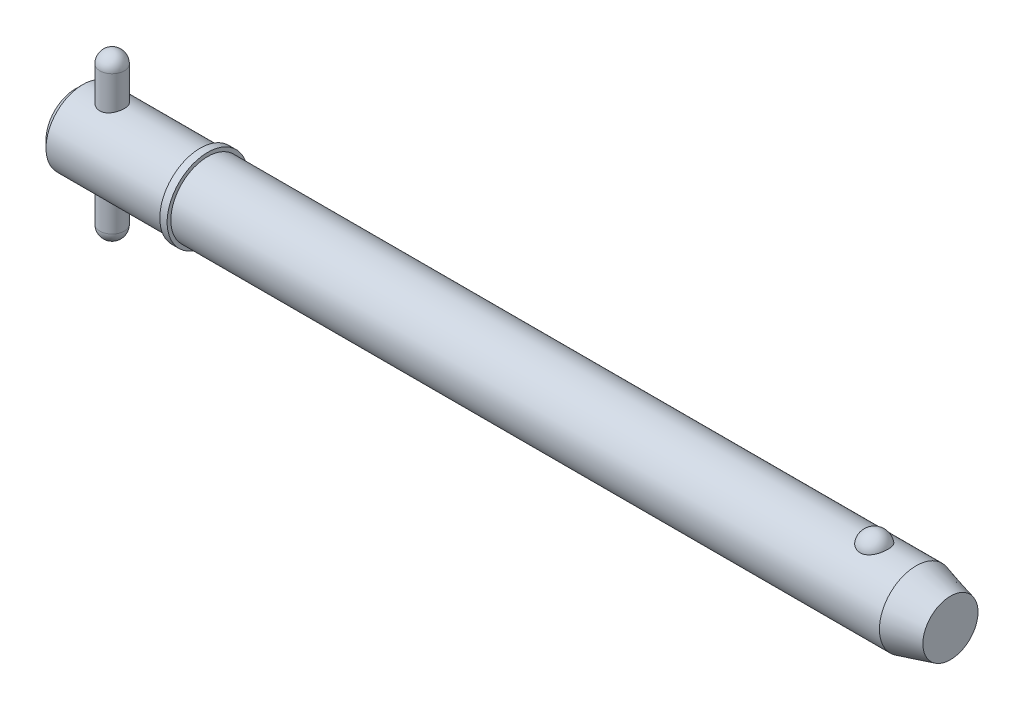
ISO-10303-21;
HEADER;
FILE_DESCRIPTION(('STEP AP214'),'2;1');
FILE_NAME('part.step','',(''),(''),'','','');
FILE_SCHEMA(('AUTOMOTIVE_DESIGN { 1 0 10303 214 1 1 1 1 }'));
ENDSEC;
DATA;
#1=APPLICATION_CONTEXT('core data for automotive mechanical design processes');
#2=APPLICATION_PROTOCOL_DEFINITION('international standard','automotive_design',2000,#1);
#3=PRODUCT_CONTEXT('',#1,'mechanical');
#4=PRODUCT('Part','Part','',(#3));
#5=PRODUCT_RELATED_PRODUCT_CATEGORY('part','',(#4));
#6=PRODUCT_DEFINITION_FORMATION('','',#4);
#7=PRODUCT_DEFINITION_CONTEXT('part definition',#1,'design');
#8=PRODUCT_DEFINITION('design','',#6,#7);
#9=PRODUCT_DEFINITION_SHAPE('','',#8);
#10=(LENGTH_UNIT() NAMED_UNIT(*) SI_UNIT(.MILLI.,.METRE.));
#11=(NAMED_UNIT(*) PLANE_ANGLE_UNIT() SI_UNIT($,.RADIAN.));
#12=(NAMED_UNIT(*) SI_UNIT($,.STERADIAN.) SOLID_ANGLE_UNIT());
#13=UNCERTAINTY_MEASURE_WITH_UNIT(LENGTH_MEASURE(1.E-05),#10,'distance_accuracy_value','');
#14=(GEOMETRIC_REPRESENTATION_CONTEXT(3) GLOBAL_UNCERTAINTY_ASSIGNED_CONTEXT((#13)) GLOBAL_UNIT_ASSIGNED_CONTEXT((#10,
#11,#12)) REPRESENTATION_CONTEXT('',''));
#15=CARTESIAN_POINT('',(0.,0.,0.));
#16=DIRECTION('',(0.,0.,1.));
#17=DIRECTION('',(1.,0.,0.));
#18=AXIS2_PLACEMENT_3D('',#15,#16,#17);
#19=CARTESIAN_POINT('',(7.14,15.875,0.));
#20=DIRECTION('',(0.,-1.,0.));
#21=DIRECTION('',(0.,0.,-1.));
#22=AXIS2_PLACEMENT_3D('',#19,#20,#21);
#23=CYLINDRICAL_SURFACE('',#22,2.38);
#24=CARTESIAN_POINT('',(7.14,-13.495,0.));
#25=DIRECTION('',(0.,-1.,0.));
#26=DIRECTION('',(0.,0.,-1.));
#27=AXIS2_PLACEMENT_3D('',#24,#25,#26);
#28=CIRCLE('',#27,2.38);
#29=CARTESIAN_POINT('',(7.14,-13.495,-2.38));
#30=VERTEX_POINT('',#29);
#31=EDGE_CURVE('P0_E10',#30,#30,#28,.F.);
#32=ORIENTED_EDGE('',*,*,#31,.T.);
#33=EDGE_LOOP('',(#32));
#34=FACE_BOUND('',#33,.T.);
#35=CARTESIAN_POINT('',(7.14,13.495,0.));
#36=DIRECTION('',(0.,-1.,0.));
#37=DIRECTION('',(0.,0.,-1.));
#38=AXIS2_PLACEMENT_3D('',#35,#36,#37);
#39=CIRCLE('',#38,2.38);
#40=CARTESIAN_POINT('',(7.14,13.495,-2.38));
#41=VERTEX_POINT('',#40);
#42=EDGE_CURVE('P0_E21',#41,#41,#39,.T.);
#43=ORIENTED_EDGE('',*,*,#42,.T.);
#44=EDGE_LOOP('',(#43));
#45=FACE_BOUND('',#44,.T.);
#46=ADVANCED_FACE('P0_F14',(#34,#45),#23,.T.);
#47=CARTESIAN_POINT('',(7.14,-13.495,0.));
#48=DIRECTION('',(0.,0.,1.));
#49=DIRECTION('',(1.,0.,0.));
#50=AXIS2_PLACEMENT_3D('',#47,#48,#49);
#51=SPHERICAL_SURFACE('',#50,2.38);
#52=CARTESIAN_POINT('',(7.14,-13.495,0.));
#53=DIRECTION('',(0.,-1.,0.));
#54=DIRECTION('',(0.,0.,-1.));
#55=AXIS2_PLACEMENT_3D('',#52,#53,#54);
#56=SPHERICAL_SURFACE('',#55,2.38);
#57=ORIENTED_EDGE('',*,*,#31,.F.);
#58=EDGE_LOOP('',(#57));
#59=FACE_BOUND('',#58,.T.);
#60=ADVANCED_FACE('P0_F29',(#59),#56,.T.);
#61=CARTESIAN_POINT('',(7.14,13.495,0.));
#62=DIRECTION('',(0.,0.,1.));
#63=DIRECTION('',(1.,0.,0.));
#64=AXIS2_PLACEMENT_3D('',#61,#62,#63);
#65=SPHERICAL_SURFACE('',#64,2.38);
#66=CARTESIAN_POINT('',(7.14,13.495,0.));
#67=DIRECTION('',(0.,-1.,0.));
#68=DIRECTION('',(0.,0.,-1.));
#69=AXIS2_PLACEMENT_3D('',#66,#67,#68);
#70=SPHERICAL_SURFACE('',#69,2.38);
#71=ORIENTED_EDGE('',*,*,#42,.F.);
#72=EDGE_LOOP('',(#71));
#73=FACE_BOUND('',#72,.T.);
#74=ADVANCED_FACE('P0_F16',(#73),#70,.T.);
#75=CLOSED_SHELL('',(#46,#60,#74));
#76=MANIFOLD_SOLID_BREP('P0_B1',#75);
#77=CARTESIAN_POINT('',(0.,0.,0.));
#78=DIRECTION('',(1.,0.,0.));
#79=DIRECTION('',(0.,0.,-1.));
#80=AXIS2_PLACEMENT_3D('',#77,#78,#79);
#81=CYLINDRICAL_SURFACE('',#80,7.145);
#82=CARTESIAN_POINT('',(163.48362424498,0.,0.));
#83=DIRECTION('',(1.,0.,0.));
#84=DIRECTION('',(0.,0.,-1.));
#85=AXIS2_PLACEMENT_3D('',#82,#83,#84);
#86=CIRCLE('',#85,7.145);
#87=CARTESIAN_POINT('',(163.48362424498,0.,-7.145));
#88=VERTEX_POINT('',#87);
#89=EDGE_CURVE('P1_E81',#88,#88,#86,.T.);
#90=ORIENTED_EDGE('',*,*,#89,.F.);
#91=EDGE_LOOP('',(#90));
#92=FACE_BOUND('',#91,.T.);
#93=CARTESIAN_POINT('',(25.7,0.,0.));
#94=DIRECTION('',(1.,0.,0.));
#95=DIRECTION('',(0.,0.,-1.));
#96=AXIS2_PLACEMENT_3D('',#93,#94,#95);
#97=CIRCLE('',#96,7.145);
#98=CARTESIAN_POINT('',(25.7,0.,-7.145));
#99=VERTEX_POINT('',#98);
#100=EDGE_CURVE('P1_E85',#99,#99,#97,.T.);
#101=ORIENTED_EDGE('',*,*,#100,.T.);
#102=EDGE_LOOP('',(#101));
#103=FACE_BOUND('',#102,.T.);
#104=CARTESIAN_POINT('',(155.339503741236,6.60328629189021,2.72903557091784));
#105=CARTESIAN_POINT('',(155.198315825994,6.60329644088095,2.7290249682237));
#106=CARTESIAN_POINT('',(155.056883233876,6.60799490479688,2.71772840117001));
#107=CARTESIAN_POINT('',(154.777955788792,6.62628236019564,2.6728193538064));
#108=CARTESIAN_POINT('',(154.640472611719,6.63989534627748,2.63914664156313));
#109=CARTESIAN_POINT('',(154.373889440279,6.67440775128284,2.55059642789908));
#110=CARTESIAN_POINT('',(154.244768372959,6.69528793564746,2.49577486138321));
#111=CARTESIAN_POINT('',(153.997869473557,6.74205585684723,2.36651799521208));
#112=CARTESIAN_POINT('',(153.880086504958,6.76794130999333,2.2920916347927));
#113=CARTESIAN_POINT('',(153.65516710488,6.82286177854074,2.12312937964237));
#114=CARTESIAN_POINT('',(153.548440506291,6.85196655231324,2.0280710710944));
#115=CARTESIAN_POINT('',(153.351918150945,6.90970232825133,1.82167822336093));
#116=CARTESIAN_POINT('',(153.262127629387,6.93833318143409,1.71033867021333));
#117=CARTESIAN_POINT('',(153.097667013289,6.9935167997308,1.46891951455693));
#118=CARTESIAN_POINT('',(153.023844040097,7.01992110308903,1.33822781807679));
#119=CARTESIAN_POINT('',(152.898088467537,7.06643385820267,1.0656656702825));
#120=CARTESIAN_POINT('',(152.84615735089,7.08654188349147,0.923794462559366));
#121=CARTESIAN_POINT('',(152.764732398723,7.11862399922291,0.630993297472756));
#122=CARTESIAN_POINT('',(152.735516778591,7.13049704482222,0.479974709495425));
#123=CARTESIAN_POINT('',(152.701174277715,7.14449484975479,0.174782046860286));
#124=CARTESIAN_POINT('',(152.696046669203,7.14661990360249,0.020608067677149));
#125=CARTESIAN_POINT('',(152.709938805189,7.14092465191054,-0.285506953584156));
#126=CARTESIAN_POINT('',(152.728810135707,7.1331654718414,-0.437455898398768));
#127=CARTESIAN_POINT('',(152.790062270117,7.10859076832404,-0.73577860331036));
#128=CARTESIAN_POINT('',(152.832443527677,7.0917750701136,-0.882152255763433));
#129=CARTESIAN_POINT('',(152.939934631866,7.05076716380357,-1.16543149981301));
#130=CARTESIAN_POINT('',(153.005075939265,7.02656475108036,-1.30232366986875));
#131=CARTESIAN_POINT('',(153.156759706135,6.97329145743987,-1.56265907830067));
#132=CARTESIAN_POINT('',(153.243303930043,6.94422017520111,-1.68610120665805));
#133=CARTESIAN_POINT('',(153.436465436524,6.88415108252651,-1.91671004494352));
#134=CARTESIAN_POINT('',(153.543180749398,6.85314438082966,-2.02379244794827));
#135=CARTESIAN_POINT('',(153.773974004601,6.79282069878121,-2.21787433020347));
#136=CARTESIAN_POINT('',(153.898050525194,6.76350358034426,-2.30487545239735));
#137=CARTESIAN_POINT('',(154.157678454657,6.71060580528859,-2.45458647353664));
#138=CARTESIAN_POINT('',(154.292938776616,6.68691885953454,-2.51776240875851));
#139=CARTESIAN_POINT('',(154.573277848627,6.64741247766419,-2.62030218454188));
#140=CARTESIAN_POINT('',(154.718352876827,6.63159007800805,-2.65967499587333));
#141=CARTESIAN_POINT('',(155.006347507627,6.61038594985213,-2.71193301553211));
#142=CARTESIAN_POINT('',(155.14900807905,6.60451880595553,-2.72605165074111));
#143=CARTESIAN_POINT('',(155.434800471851,6.60240611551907,-2.73116688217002));
#144=CARTESIAN_POINT('',(155.577932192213,6.60615862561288,-2.7221681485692));
#145=CARTESIAN_POINT('',(155.855848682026,6.62256094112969,-2.68200435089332));
#146=CARTESIAN_POINT('',(155.990754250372,6.63492533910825,-2.65154998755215));
#147=CARTESIAN_POINT('',(156.25332009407,6.66687445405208,-2.57015684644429));
#148=CARTESIAN_POINT('',(156.38097978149,6.68645975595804,-2.51921640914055));
#149=CARTESIAN_POINT('',(156.628577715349,6.73127274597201,-2.39693610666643));
#150=CARTESIAN_POINT('',(156.748287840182,6.7566138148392,-2.32517694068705));
#151=CARTESIAN_POINT('',(156.974159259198,6.81006003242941,-2.16363812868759));
#152=CARTESIAN_POINT('',(157.080317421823,6.83816581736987,-2.07385432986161));
#153=CARTESIAN_POINT('',(157.281862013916,6.89580469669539,-1.87357235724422));
#154=CARTESIAN_POINT('',(157.376440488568,6.92533863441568,-1.76226074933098));
#155=CARTESIAN_POINT('',(157.546332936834,6.98139526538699,-1.5251169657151));
#156=CARTESIAN_POINT('',(157.621643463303,7.0079174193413,-1.39928219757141));
#157=CARTESIAN_POINT('',(157.753595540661,7.05607625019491,-1.1321597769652));
#158=CARTESIAN_POINT('',(157.809568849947,7.07753119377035,-0.990508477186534));
#159=CARTESIAN_POINT('',(157.898296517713,7.11222355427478,-0.699154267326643));
#160=CARTESIAN_POINT('',(157.931050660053,7.12546089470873,-0.549451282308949));
#161=CARTESIAN_POINT('',(157.972689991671,7.14237584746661,-0.246120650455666));
#162=CARTESIAN_POINT('',(157.981558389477,7.14604673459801,-0.0924903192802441));
#163=CARTESIAN_POINT('',(157.975194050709,7.14343510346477,0.214181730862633));
#164=CARTESIAN_POINT('',(157.959961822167,7.13715279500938,0.367223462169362));
#165=CARTESIAN_POINT('',(157.905845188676,7.1153294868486,0.667595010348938));
#166=CARTESIAN_POINT('',(157.867077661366,7.09983424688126,0.814949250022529));
#167=CARTESIAN_POINT('',(157.766770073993,7.06119140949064,1.1006322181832));
#168=CARTESIAN_POINT('',(157.705228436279,7.03804328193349,1.23896032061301));
#169=CARTESIAN_POINT('',(157.560207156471,6.98632429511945,1.50352300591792));
#170=CARTESIAN_POINT('',(157.476606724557,6.95772382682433,1.62968561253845));
#171=CARTESIAN_POINT('',(157.28938046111,6.89823072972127,1.86554304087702));
#172=CARTESIAN_POINT('',(157.185755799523,6.86733823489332,1.97523882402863));
#173=CARTESIAN_POINT('',(156.961076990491,6.80676456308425,2.174822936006));
#174=CARTESIAN_POINT('',(156.840067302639,6.7770805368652,2.26476035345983));
#175=CARTESIAN_POINT('',(156.583340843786,6.7223050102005,2.42252989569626));
#176=CARTESIAN_POINT('',(156.44761851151,6.69721525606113,2.4903536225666));
#177=CARTESIAN_POINT('',(156.170402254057,6.65552591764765,2.59967646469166));
#178=CARTESIAN_POINT('',(156.029281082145,6.63865794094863,2.6420201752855));
#179=CARTESIAN_POINT('',(155.741444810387,6.61425039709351,2.70255841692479));
#180=CARTESIAN_POINT('',(155.594748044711,6.606682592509,2.72082606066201));
#181=CARTESIAN_POINT('',(155.411679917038,6.60358754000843,2.72830331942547));
#182=CARTESIAN_POINT('',(155.375599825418,6.60328369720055,2.72903828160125));
#183=CARTESIAN_POINT('',(155.339503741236,6.60328629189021,2.72903557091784));
#184=B_SPLINE_CURVE_WITH_KNOTS('',3,(#104,#105,#106,#107,#108,#109,#110,#111,#112,#113,#114,
#115,#116,#117,#118,#119,#120,#121,#122,#123,#124,#125,#126,#127,#128,#129,#130,#131,#132,#133,
#134,#135,#136,#137,#138,#139,#140,#141,#142,#143,#144,#145,#146,#147,#148,#149,#150,#151,#152,
#153,#154,#155,#156,#157,#158,#159,#160,#161,#162,#163,#164,#165,#166,#167,#168,#169,#170,#171,
#172,#173,#174,#175,#176,#177,#178,#179,#180,#181,#182,#183),.UNSPECIFIED.,.T.,.F.,(4,2,2,2,2,2,
2,2,2,2,2,2,2,2,2,2,2,2,2,2,2,2,2,2,2,2,2,2,2,2,2,2,2,2,2,2,2,2,2,4),(0.,0.423468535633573,
0.848081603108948,1.27157926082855,1.69488414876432,2.13051395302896,2.56627819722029,
3.02136706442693,3.47648674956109,3.93709649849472,4.39769233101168,4.85545355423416,
5.31322361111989,5.77162895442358,6.23007210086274,6.6908033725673,7.15149693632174,
7.60264329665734,8.05361952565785,8.48189729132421,8.91008854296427,9.32472524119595,
9.73939553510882,10.1630783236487,10.5868588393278,11.0319070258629,11.4770347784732,
11.9362874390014,12.3955443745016,12.8551240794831,13.3146940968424,13.7720003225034,
14.2293382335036,14.6892343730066,15.1491036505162,15.6078171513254,16.0667046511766,
16.5093965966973,16.9507410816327,17.0590049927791),.UNSPECIFIED.);
#185=CARTESIAN_POINT('',(155.339503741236,6.60328629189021,2.72903557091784));
#186=VERTEX_POINT('',#185);
#187=EDGE_CURVE('P1_E35',#186,#186,#184,.T.);
#188=ORIENTED_EDGE('',*,*,#187,.T.);
#189=EDGE_LOOP('',(#188));
#190=FACE_BOUND('',#189,.T.);
#191=ADVANCED_FACE('P1_F13',(#92,#103,#190),#81,.T.);
#192=CARTESIAN_POINT('',(0.,0.,0.));
#193=DIRECTION('',(-1.,0.,0.));
#194=DIRECTION('',(0.,0.,1.));
#195=AXIS2_PLACEMENT_3D('',#192,#193,#194);
#196=PLANE('',#195);
#197=CARTESIAN_POINT('',(0.,0.,0.));
#198=DIRECTION('',(1.,0.,0.));
#199=DIRECTION('',(0.,0.,-1.));
#200=AXIS2_PLACEMENT_3D('',#197,#198,#199);
#201=CIRCLE('',#200,5.716);
#202=CARTESIAN_POINT('',(0.,0.,-5.716));
#203=VERTEX_POINT('',#202);
#204=EDGE_CURVE('P1_E9',#203,#203,#201,.T.);
#205=ORIENTED_EDGE('',*,*,#204,.F.);
#206=EDGE_LOOP('',(#205));
#207=FACE_BOUND('',#206,.T.);
#208=ADVANCED_FACE('P1_F15',(#207),#196,.T.);
#209=CARTESIAN_POINT('',(1.42899999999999,0.,0.));
#210=DIRECTION('',(1.,0.,0.));
#211=DIRECTION('',(0.,0.,-1.));
#212=AXIS2_PLACEMENT_3D('',#209,#210,#211);
#213=CONICAL_SURFACE('',#212,7.145,0.78539816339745);
#214=ORIENTED_EDGE('',*,*,#204,.T.);
#215=EDGE_LOOP('',(#214));
#216=FACE_BOUND('',#215,.T.);
#217=CARTESIAN_POINT('',(1.42899999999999,0.,0.));
#218=DIRECTION('',(1.,0.,0.));
#219=DIRECTION('',(0.,0.,-1.));
#220=AXIS2_PLACEMENT_3D('',#217,#218,#219);
#221=CIRCLE('',#220,7.145);
#222=CARTESIAN_POINT('',(1.42899999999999,0.,-7.145));
#223=VERTEX_POINT('',#222);
#224=EDGE_CURVE('P1_E26',#223,#223,#221,.T.);
#225=ORIENTED_EDGE('',*,*,#224,.F.);
#226=EDGE_LOOP('',(#225));
#227=FACE_BOUND('',#226,.T.);
#228=ADVANCED_FACE('P1_F77',(#216,#227),#213,.T.);
#229=CARTESIAN_POINT('',(0.,0.,0.));
#230=DIRECTION('',(1.,0.,0.));
#231=DIRECTION('',(0.,0.,-1.));
#232=AXIS2_PLACEMENT_3D('',#229,#230,#231);
#233=CYLINDRICAL_SURFACE('',#232,7.145);
#234=CARTESIAN_POINT('',(7.14,-6.73695962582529,2.38));
#235=CARTESIAN_POINT('',(7.01035997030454,-6.73695921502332,2.38000059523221));
#236=CARTESIAN_POINT('',(6.88072348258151,-6.74074253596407,2.36937183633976));
#237=CARTESIAN_POINT('',(6.62529075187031,-6.75538853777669,2.32728080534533));
#238=CARTESIAN_POINT('',(6.49949514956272,-6.76625239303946,2.29581507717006));
#239=CARTESIAN_POINT('',(6.2554858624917,-6.79369535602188,2.21327763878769));
#240=CARTESIAN_POINT('',(6.13725786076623,-6.81026326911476,2.16224430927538));
#241=CARTESIAN_POINT('',(5.91100349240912,-6.84723128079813,2.04215132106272));
#242=CARTESIAN_POINT('',(5.80297937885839,-6.86763222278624,1.97308769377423));
#243=CARTESIAN_POINT('',(5.59597854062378,-6.91086152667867,1.81600414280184));
#244=CARTESIAN_POINT('',(5.49745861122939,-6.93375032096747,1.72739874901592));
#245=CARTESIAN_POINT('',(5.31636508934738,-6.97886546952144,1.53499636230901));
#246=CARTESIAN_POINT('',(5.23379405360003,-7.00109171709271,1.43119693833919));
#247=CARTESIAN_POINT('',(5.08487013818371,-7.04307708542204,1.20801318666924));
#248=CARTESIAN_POINT('',(5.01899578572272,-7.06275685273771,1.08829330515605));
#249=CARTESIAN_POINT('',(4.90850130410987,-7.09671988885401,0.838703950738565));
#250=CARTESIAN_POINT('',(4.86387545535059,-7.11100460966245,0.70883722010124));
#251=CARTESIAN_POINT('',(4.79869354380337,-7.13213998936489,0.44742990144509));
#252=CARTESIAN_POINT('',(4.77735497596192,-7.13923172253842,0.316104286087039));
#253=CARTESIAN_POINT('',(4.75686536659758,-7.14603777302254,0.0515578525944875));
#254=CARTESIAN_POINT('',(4.75770861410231,-7.14575398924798,-0.0816624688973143));
#255=CARTESIAN_POINT('',(4.78106216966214,-7.13800438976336,-0.340678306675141));
#256=CARTESIAN_POINT('',(4.80272255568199,-7.13082030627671,-0.466560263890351));
#257=CARTESIAN_POINT('',(4.86569013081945,-7.11043095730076,-0.712788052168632));
#258=CARTESIAN_POINT('',(4.90699865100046,-7.09722528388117,-0.833133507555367));
#259=CARTESIAN_POINT('',(5.00858673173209,-7.06591754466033,-1.06673173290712));
#260=CARTESIAN_POINT('',(5.06910834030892,-7.0477534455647,-1.17987058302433));
#261=CARTESIAN_POINT('',(5.20720514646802,-7.00841977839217,-1.39463797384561));
#262=CARTESIAN_POINT('',(5.28478508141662,-6.987249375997,-1.49626330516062));
#263=CARTESIAN_POINT('',(5.4590800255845,-6.94296010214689,-1.69017445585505));
#264=CARTESIAN_POINT('',(5.55652324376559,-6.91979641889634,-1.78179645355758));
#265=CARTESIAN_POINT('',(5.76558873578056,-6.87497076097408,-1.94761348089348));
#266=CARTESIAN_POINT('',(5.87721318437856,-6.85330901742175,-2.02180583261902));
#267=CARTESIAN_POINT('',(6.11357367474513,-6.81369485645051,-2.15157488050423));
#268=CARTESIAN_POINT('',(6.23847358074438,-6.79579956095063,-2.20687188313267));
#269=CARTESIAN_POINT('',(6.49655785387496,-6.76640630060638,-2.29542443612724));
#270=CARTESIAN_POINT('',(6.62973872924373,-6.75490565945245,-2.32868920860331));
#271=CARTESIAN_POINT('',(6.89417536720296,-6.74020933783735,-2.37088225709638));
#272=CARTESIAN_POINT('',(7.02524746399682,-6.73666278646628,-2.38083959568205));
#273=CARTESIAN_POINT('',(7.28721035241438,-6.73729555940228,-2.37904974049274));
#274=CARTESIAN_POINT('',(7.41810117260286,-6.7414734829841,-2.36730648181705));
#275=CARTESIAN_POINT('',(7.67130717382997,-6.75673471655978,-2.32337336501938));
#276=CARTESIAN_POINT('',(7.79376251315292,-6.76757635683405,-2.29189834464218));
#277=CARTESIAN_POINT('',(8.03162917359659,-6.79467771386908,-2.21025275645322));
#278=CARTESIAN_POINT('',(8.14703924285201,-6.8109383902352,-2.16007887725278));
#279=CARTESIAN_POINT('',(8.37159169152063,-6.84768362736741,-2.04065289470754));
#280=CARTESIAN_POINT('',(8.48041962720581,-6.86828569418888,-1.97084668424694));
#281=CARTESIAN_POINT('',(8.68518919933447,-6.91116416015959,-1.8147657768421));
#282=CARTESIAN_POINT('',(8.78112702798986,-6.93344105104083,-1.72848623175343));
#283=CARTESIAN_POINT('',(8.96215574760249,-6.97845348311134,-1.53698616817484));
#284=CARTESIAN_POINT('',(9.04650427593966,-7.00115965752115,-1.43105491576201));
#285=CARTESIAN_POINT('',(9.19627592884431,-7.04341676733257,-1.20598377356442));
#286=CARTESIAN_POINT('',(9.26169972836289,-7.06296781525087,-1.08684435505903));
#287=CARTESIAN_POINT('',(9.37116617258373,-7.0966205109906,-0.83933303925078));
#288=CARTESIAN_POINT('',(9.41534821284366,-7.11075755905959,-0.711027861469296));
#289=CARTESIAN_POINT('',(9.48132660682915,-7.13214194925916,-0.448245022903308));
#290=CARTESIAN_POINT('',(9.50313102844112,-7.13939177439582,-0.313769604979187));
#291=CARTESIAN_POINT('',(9.5230098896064,-7.14599771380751,-0.049254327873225));
#292=CARTESIAN_POINT('',(9.52215013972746,-7.14570837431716,0.0806974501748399));
#293=CARTESIAN_POINT('',(9.49935359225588,-7.13814116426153,0.338518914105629));
#294=CARTESIAN_POINT('',(9.47741850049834,-7.13086385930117,0.466388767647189));
#295=CARTESIAN_POINT('',(9.4138005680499,-7.11026814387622,0.714400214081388));
#296=CARTESIAN_POINT('',(9.37243609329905,-7.09704726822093,0.834632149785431));
#297=CARTESIAN_POINT('',(9.27142829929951,-7.06592602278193,1.06649582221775));
#298=CARTESIAN_POINT('',(9.2117816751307,-7.04802480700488,1.1781259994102));
#299=CARTESIAN_POINT('',(9.07336776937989,-7.00856499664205,1.39411030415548));
#300=CARTESIAN_POINT('',(8.99397590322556,-6.98689577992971,1.49804368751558));
#301=CARTESIAN_POINT('',(8.81938810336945,-6.9426110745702,1.69146078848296));
#302=CARTESIAN_POINT('',(8.72418713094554,-6.91999528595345,1.78093988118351));
#303=CARTESIAN_POINT('',(8.51623540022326,-6.87531507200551,1.94646188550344));
#304=CARTESIAN_POINT('',(8.4029442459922,-6.85330672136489,2.02184316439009));
#305=CARTESIAN_POINT('',(8.16461714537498,-6.81342065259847,2.1524427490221));
#306=CARTESIAN_POINT('',(8.03958429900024,-6.7955418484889,2.20766635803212));
#307=CARTESIAN_POINT('',(7.78712566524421,-6.76686117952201,2.29403636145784));
#308=CARTESIAN_POINT('',(7.66006989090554,-6.75577342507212,2.32616709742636));
#309=CARTESIAN_POINT('',(7.40200728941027,-6.74082409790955,2.36914495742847));
#310=CARTESIAN_POINT('',(7.27100183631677,-6.73696004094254,2.37999939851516));
#311=CARTESIAN_POINT('',(7.14,-6.73695962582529,2.38));
#312=B_SPLINE_CURVE_WITH_KNOTS('',3,(#234,#235,#236,#237,#238,#239,#240,#241,#242,#243,#244,
#245,#246,#247,#248,#249,#250,#251,#252,#253,#254,#255,#256,#257,#258,#259,#260,#261,#262,#263,
#264,#265,#266,#267,#268,#269,#270,#271,#272,#273,#274,#275,#276,#277,#278,#279,#280,#281,#282,
#283,#284,#285,#286,#287,#288,#289,#290,#291,#292,#293,#294,#295,#296,#297,#298,#299,#300,#301,
#302,#303,#304,#305,#306,#307,#308,#309,#310,#311),.UNSPECIFIED.,.T.,.F.,(4,2,2,2,2,2,2,2,2,2,2,
2,2,2,2,2,2,2,2,2,2,2,2,2,2,2,2,2,2,2,2,2,2,2,2,2,2,2,4),(0.,0.388434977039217,
0.776934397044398,1.16467566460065,1.55250234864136,1.9540847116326,2.35573139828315,
2.76784120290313,3.17984001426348,3.57752248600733,3.97510257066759,4.35711073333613,
4.7391447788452,5.12619663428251,5.51335611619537,5.91871976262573,6.3241456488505,
6.73533623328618,7.14635459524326,7.53885245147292,7.93127914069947,8.31025106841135,
8.68929014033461,9.08033871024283,9.47150254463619,9.88145528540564,10.2913934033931,
10.6986033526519,11.1056664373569,11.4936225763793,11.8815473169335,12.2633262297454,
12.645174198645,13.0411187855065,13.437189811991,13.8487371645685,14.2601761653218,
14.6528265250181,15.0453418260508),.UNSPECIFIED.);
#313=CARTESIAN_POINT('',(7.14,-6.73695962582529,2.38));
#314=VERTEX_POINT('',#313);
#315=EDGE_CURVE('P1_E17',#314,#314,#312,.T.);
#316=ORIENTED_EDGE('',*,*,#315,.F.);
#317=EDGE_LOOP('',(#316));
#318=FACE_BOUND('',#317,.T.);
#319=CARTESIAN_POINT('',(7.14,6.73695962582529,2.38));
#320=CARTESIAN_POINT('',(7.26964002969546,6.73695921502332,2.38000059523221));
#321=CARTESIAN_POINT('',(7.39927651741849,6.74074253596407,2.36937183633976));
#322=CARTESIAN_POINT('',(7.65470924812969,6.75538853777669,2.32728080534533));
#323=CARTESIAN_POINT('',(7.78050485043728,6.76625239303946,2.29581507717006));
#324=CARTESIAN_POINT('',(8.02451413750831,6.79369535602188,2.21327763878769));
#325=CARTESIAN_POINT('',(8.14274213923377,6.81026326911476,2.16224430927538));
#326=CARTESIAN_POINT('',(8.36899650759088,6.84723128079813,2.04215132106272));
#327=CARTESIAN_POINT('',(8.47702062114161,6.86763222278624,1.97308769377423));
#328=CARTESIAN_POINT('',(8.68402145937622,6.91086152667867,1.81600414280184));
#329=CARTESIAN_POINT('',(8.78254138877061,6.93375032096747,1.72739874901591));
#330=CARTESIAN_POINT('',(8.96363491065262,6.97886546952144,1.53499636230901));
#331=CARTESIAN_POINT('',(9.04620594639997,7.00109171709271,1.43119693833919));
#332=CARTESIAN_POINT('',(9.19512986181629,7.04307708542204,1.20801318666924));
#333=CARTESIAN_POINT('',(9.26100421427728,7.06275685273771,1.08829330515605));
#334=CARTESIAN_POINT('',(9.37149869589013,7.09671988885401,0.838703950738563));
#335=CARTESIAN_POINT('',(9.41612454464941,7.11100460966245,0.708837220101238));
#336=CARTESIAN_POINT('',(9.48130645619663,7.13213998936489,0.447429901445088));
#337=CARTESIAN_POINT('',(9.50264502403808,7.13923172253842,0.316104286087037));
#338=CARTESIAN_POINT('',(9.52313463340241,7.14603777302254,0.0515578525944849));
#339=CARTESIAN_POINT('',(9.52229138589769,7.14575398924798,-0.0816624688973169));
#340=CARTESIAN_POINT('',(9.49893783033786,7.13800438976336,-0.340678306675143));
#341=CARTESIAN_POINT('',(9.47727744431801,7.13082030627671,-0.466560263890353));
#342=CARTESIAN_POINT('',(9.41430986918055,7.11043095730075,-0.712788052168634));
#343=CARTESIAN_POINT('',(9.37300134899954,7.09722528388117,-0.833133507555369));
#344=CARTESIAN_POINT('',(9.27141326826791,7.06591754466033,-1.06673173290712));
#345=CARTESIAN_POINT('',(9.21089165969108,7.0477534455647,-1.17987058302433));
#346=CARTESIAN_POINT('',(9.07279485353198,7.00841977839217,-1.39463797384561));
#347=CARTESIAN_POINT('',(8.99521491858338,6.987249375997,-1.49626330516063));
#348=CARTESIAN_POINT('',(8.82091997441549,6.94296010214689,-1.69017445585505));
#349=CARTESIAN_POINT('',(8.72347675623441,6.91979641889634,-1.78179645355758));
#350=CARTESIAN_POINT('',(8.51441126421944,6.87497076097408,-1.94761348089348));
#351=CARTESIAN_POINT('',(8.40278681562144,6.85330901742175,-2.02180583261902));
#352=CARTESIAN_POINT('',(8.16642632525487,6.81369485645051,-2.15157488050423));
#353=CARTESIAN_POINT('',(8.04152641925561,6.79579956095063,-2.20687188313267));
#354=CARTESIAN_POINT('',(7.78344214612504,6.76640630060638,-2.29542443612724));
#355=CARTESIAN_POINT('',(7.65026127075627,6.75490565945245,-2.32868920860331));
#356=CARTESIAN_POINT('',(7.38582463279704,6.74020933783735,-2.37088225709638));
#357=CARTESIAN_POINT('',(7.25475253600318,6.73666278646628,-2.38083959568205));
#358=CARTESIAN_POINT('',(6.99278964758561,6.73729555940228,-2.37904974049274));
#359=CARTESIAN_POINT('',(6.86189882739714,6.7414734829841,-2.36730648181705));
#360=CARTESIAN_POINT('',(6.60869282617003,6.75673471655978,-2.32337336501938));
#361=CARTESIAN_POINT('',(6.48623748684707,6.76757635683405,-2.29189834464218));
#362=CARTESIAN_POINT('',(6.2483708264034,6.79467771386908,-2.21025275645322));
#363=CARTESIAN_POINT('',(6.13296075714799,6.8109383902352,-2.16007887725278));
#364=CARTESIAN_POINT('',(5.90840830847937,6.84768362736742,-2.04065289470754));
#365=CARTESIAN_POINT('',(5.79958037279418,6.86828569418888,-1.97084668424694));
#366=CARTESIAN_POINT('',(5.59481080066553,6.91116416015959,-1.8147657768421));
#367=CARTESIAN_POINT('',(5.49887297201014,6.93344105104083,-1.72848623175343));
#368=CARTESIAN_POINT('',(5.31784425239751,6.97845348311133,-1.53698616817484));
#369=CARTESIAN_POINT('',(5.23349572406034,7.00115965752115,-1.43105491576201));
#370=CARTESIAN_POINT('',(5.08372407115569,7.04341676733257,-1.20598377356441));
#371=CARTESIAN_POINT('',(5.01830027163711,7.06296781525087,-1.08684435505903));
#372=CARTESIAN_POINT('',(4.90883382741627,7.0966205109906,-0.839333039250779));
#373=CARTESIAN_POINT('',(4.86465178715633,7.11075755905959,-0.711027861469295));
#374=CARTESIAN_POINT('',(4.79867339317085,7.13214194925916,-0.448245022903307));
#375=CARTESIAN_POINT('',(4.77686897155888,7.13939177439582,-0.313769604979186));
#376=CARTESIAN_POINT('',(4.7569901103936,7.14599771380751,-0.0492543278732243));
#377=CARTESIAN_POINT('',(4.75784986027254,7.14570837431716,0.0806974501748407));
#378=CARTESIAN_POINT('',(4.78064640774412,7.13814116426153,0.33851891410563));
#379=CARTESIAN_POINT('',(4.80258149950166,7.13086385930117,0.46638876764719));
#380=CARTESIAN_POINT('',(4.8661994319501,7.11026814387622,0.714400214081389));
#381=CARTESIAN_POINT('',(4.90756390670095,7.09704726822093,0.834632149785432));
#382=CARTESIAN_POINT('',(5.00857170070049,7.06592602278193,1.06649582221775));
#383=CARTESIAN_POINT('',(5.0682183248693,7.04802480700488,1.1781259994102));
#384=CARTESIAN_POINT('',(5.20663223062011,7.00856499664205,1.39411030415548));
#385=CARTESIAN_POINT('',(5.28602409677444,6.98689577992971,1.49804368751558));
#386=CARTESIAN_POINT('',(5.46061189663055,6.9426110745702,1.69146078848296));
#387=CARTESIAN_POINT('',(5.55581286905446,6.91999528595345,1.78093988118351));
#388=CARTESIAN_POINT('',(5.76376459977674,6.87531507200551,1.94646188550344));
#389=CARTESIAN_POINT('',(5.8770557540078,6.85330672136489,2.02184316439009));
#390=CARTESIAN_POINT('',(6.11538285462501,6.81342065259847,2.1524427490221));
#391=CARTESIAN_POINT('',(6.24041570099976,6.7955418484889,2.20766635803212));
#392=CARTESIAN_POINT('',(6.4928743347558,6.76686117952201,2.29403636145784));
#393=CARTESIAN_POINT('',(6.61993010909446,6.75577342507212,2.32616709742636));
#394=CARTESIAN_POINT('',(6.87799271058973,6.74082409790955,2.36914495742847));
#395=CARTESIAN_POINT('',(7.00899816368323,6.73696004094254,2.37999939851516));
#396=CARTESIAN_POINT('',(7.14,6.73695962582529,2.38));
#397=B_SPLINE_CURVE_WITH_KNOTS('',3,(#319,#320,#321,#322,#323,#324,#325,#326,#327,#328,#329,
#330,#331,#332,#333,#334,#335,#336,#337,#338,#339,#340,#341,#342,#343,#344,#345,#346,#347,#348,
#349,#350,#351,#352,#353,#354,#355,#356,#357,#358,#359,#360,#361,#362,#363,#364,#365,#366,#367,
#368,#369,#370,#371,#372,#373,#374,#375,#376,#377,#378,#379,#380,#381,#382,#383,#384,#385,#386,
#387,#388,#389,#390,#391,#392,#393,#394,#395,#396),.UNSPECIFIED.,.T.,.F.,(4,2,2,2,2,2,2,2,2,2,2,
2,2,2,2,2,2,2,2,2,2,2,2,2,2,2,2,2,2,2,2,2,2,2,2,2,2,2,4),(0.,0.388434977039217,
0.776934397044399,1.16467566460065,1.55250234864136,1.9540847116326,2.35573139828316,
2.76784120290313,3.17984001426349,3.57752248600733,3.97510257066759,4.35711073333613,
4.73914477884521,5.12619663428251,5.51335611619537,5.91871976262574,6.3241456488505,
6.73533623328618,7.14635459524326,7.53885245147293,7.93127914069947,8.31025106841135,
8.68929014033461,9.08033871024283,9.47150254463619,9.88145528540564,10.2913934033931,
10.6986033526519,11.1056664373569,11.4936225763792,11.8815473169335,12.2633262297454,
12.645174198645,13.0411187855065,13.437189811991,13.8487371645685,14.2601761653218,
14.6528265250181,15.0453418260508),.UNSPECIFIED.);
#398=CARTESIAN_POINT('',(7.14,6.73695962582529,2.38));
#399=VERTEX_POINT('',#398);
#400=EDGE_CURVE('P1_E43',#399,#399,#397,.T.);
#401=ORIENTED_EDGE('',*,*,#400,.F.);
#402=EDGE_LOOP('',(#401));
#403=FACE_BOUND('',#402,.T.);
#404=ORIENTED_EDGE('',*,*,#224,.T.);
#405=EDGE_LOOP('',(#404));
#406=FACE_BOUND('',#405,.T.);
#407=CARTESIAN_POINT('',(24.271,0.,0.));
#408=DIRECTION('',(1.,0.,0.));
#409=DIRECTION('',(0.,0.,-1.));
#410=AXIS2_PLACEMENT_3D('',#407,#408,#409);
#411=CIRCLE('',#410,7.145);
#412=CARTESIAN_POINT('',(24.271,0.,-7.145));
#413=VERTEX_POINT('',#412);
#414=EDGE_CURVE('P1_E31',#413,#413,#411,.T.);
#415=ORIENTED_EDGE('',*,*,#414,.F.);
#416=EDGE_LOOP('',(#415));
#417=FACE_BOUND('',#416,.T.);
#418=ADVANCED_FACE('P1_F103',(#318,#403,#406,#417),#233,.T.);
#419=CARTESIAN_POINT('',(24.271,7.145,0.));
#420=DIRECTION('',(-1.,0.,0.));
#421=DIRECTION('',(0.,0.,1.));
#422=AXIS2_PLACEMENT_3D('',#419,#420,#421);
#423=PLANE('',#422);
#424=ORIENTED_EDGE('',*,*,#414,.T.);
#425=EDGE_LOOP('',(#424));
#426=FACE_BOUND('',#425,.T.);
#427=CARTESIAN_POINT('',(24.271,0.,0.));
#428=DIRECTION('',(1.,0.,0.));
#429=DIRECTION('',(0.,0.,-1.));
#430=AXIS2_PLACEMENT_3D('',#427,#428,#429);
#431=CIRCLE('',#430,7.8595);
#432=CARTESIAN_POINT('',(24.271,0.,-7.8595));
#433=VERTEX_POINT('',#432);
#434=EDGE_CURVE('P1_E91',#433,#433,#431,.T.);
#435=ORIENTED_EDGE('',*,*,#434,.F.);
#436=EDGE_LOOP('',(#435));
#437=FACE_BOUND('',#436,.T.);
#438=ADVANCED_FACE('P1_F100',(#426,#437),#423,.T.);
#439=CARTESIAN_POINT('',(0.,0.,0.));
#440=DIRECTION('',(1.,0.,0.));
#441=DIRECTION('',(0.,0.,-1.));
#442=AXIS2_PLACEMENT_3D('',#439,#440,#441);
#443=CYLINDRICAL_SURFACE('',#442,7.8595);
#444=ORIENTED_EDGE('',*,*,#434,.T.);
#445=EDGE_LOOP('',(#444));
#446=FACE_BOUND('',#445,.T.);
#447=CARTESIAN_POINT('',(25.7,0.,0.));
#448=DIRECTION('',(1.,0.,0.));
#449=DIRECTION('',(0.,0.,-1.));
#450=AXIS2_PLACEMENT_3D('',#447,#448,#449);
#451=CIRCLE('',#450,7.8595);
#452=CARTESIAN_POINT('',(25.7,0.,-7.8595));
#453=VERTEX_POINT('',#452);
#454=EDGE_CURVE('P1_E88',#453,#453,#451,.T.);
#455=ORIENTED_EDGE('',*,*,#454,.F.);
#456=EDGE_LOOP('',(#455));
#457=FACE_BOUND('',#456,.T.);
#458=ADVANCED_FACE('P1_F68',(#446,#457),#443,.T.);
#459=CARTESIAN_POINT('',(25.7,7.8595,0.));
#460=DIRECTION('',(1.,0.,0.));
#461=DIRECTION('',(0.,0.,-1.));
#462=AXIS2_PLACEMENT_3D('',#459,#460,#461);
#463=PLANE('',#462);
#464=ORIENTED_EDGE('',*,*,#454,.T.);
#465=EDGE_LOOP('',(#464));
#466=FACE_BOUND('',#465,.T.);
#467=ORIENTED_EDGE('',*,*,#100,.F.);
#468=EDGE_LOOP('',(#467));
#469=FACE_BOUND('',#468,.T.);
#470=ADVANCED_FACE('P1_F62',(#466,#469),#463,.T.);
#471=CARTESIAN_POINT('',(170.15,0.,0.));
#472=DIRECTION('',(-1.,0.,0.));
#473=DIRECTION('',(0.,0.,1.));
#474=AXIS2_PLACEMENT_3D('',#471,#472,#473);
#475=CONICAL_SURFACE('',#474,5.35875000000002,0.261799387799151);
#476=ORIENTED_EDGE('',*,*,#89,.T.);
#477=EDGE_LOOP('',(#476));
#478=FACE_BOUND('',#477,.T.);
#479=CARTESIAN_POINT('',(170.15,0.,0.));
#480=DIRECTION('',(1.,0.,0.));
#481=DIRECTION('',(0.,0.,-1.));
#482=AXIS2_PLACEMENT_3D('',#479,#480,#481);
#483=CIRCLE('',#482,5.35875000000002);
#484=CARTESIAN_POINT('',(170.15,0.,-5.35875000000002));
#485=VERTEX_POINT('',#484);
#486=EDGE_CURVE('P1_E42',#485,#485,#483,.T.);
#487=ORIENTED_EDGE('',*,*,#486,.F.);
#488=EDGE_LOOP('',(#487));
#489=FACE_BOUND('',#488,.T.);
#490=ADVANCED_FACE('P1_F59',(#478,#489),#475,.T.);
#491=CARTESIAN_POINT('',(170.15,5.35875000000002,0.));
#492=DIRECTION('',(1.,0.,0.));
#493=DIRECTION('',(0.,0.,-1.));
#494=AXIS2_PLACEMENT_3D('',#491,#492,#493);
#495=PLANE('',#494);
#496=ORIENTED_EDGE('',*,*,#486,.T.);
#497=EDGE_LOOP('',(#496));
#498=FACE_BOUND('',#497,.T.);
#499=ADVANCED_FACE('P1_F55',(#498),#495,.T.);
#500=CARTESIAN_POINT('',(155.339503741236,6.4305,0.));
#501=DIRECTION('',(-1.,0.,0.));
#502=DIRECTION('',(0.,-1.,0.));
#503=AXIS2_PLACEMENT_3D('',#500,#501,#502);
#504=SPHERICAL_SURFACE('',#503,2.7345);
#505=ORIENTED_EDGE('',*,*,#187,.F.);
#506=EDGE_LOOP('',(#505));
#507=FACE_BOUND('',#506,.T.);
#508=ADVANCED_FACE('P1_F50',(#507),#504,.T.);
#509=CARTESIAN_POINT('',(7.14,-7.8595,0.));
#510=DIRECTION('',(0.,1.,0.));
#511=DIRECTION('',(0.,0.,1.));
#512=AXIS2_PLACEMENT_3D('',#509,#510,#511);
#513=CYLINDRICAL_SURFACE('',#512,2.38);
#514=ORIENTED_EDGE('',*,*,#315,.T.);
#515=EDGE_LOOP('',(#514));
#516=FACE_BOUND('',#515,.T.);
#517=ORIENTED_EDGE('',*,*,#400,.T.);
#518=EDGE_LOOP('',(#517));
#519=FACE_BOUND('',#518,.T.);
#520=ADVANCED_FACE('P1_F54',(#516,#519),#513,.F.);
#521=CLOSED_SHELL('',(#191,#208,#228,#418,#438,#458,#470,#490,#499,#508,#520));
#522=MANIFOLD_SOLID_BREP('P1_B1',#521);
#523=ADVANCED_BREP_SHAPE_REPRESENTATION('',(#18,#76,#522),#14);
#524=SHAPE_DEFINITION_REPRESENTATION(#9,#523);
ENDSEC;
END-ISO-10303-21;
